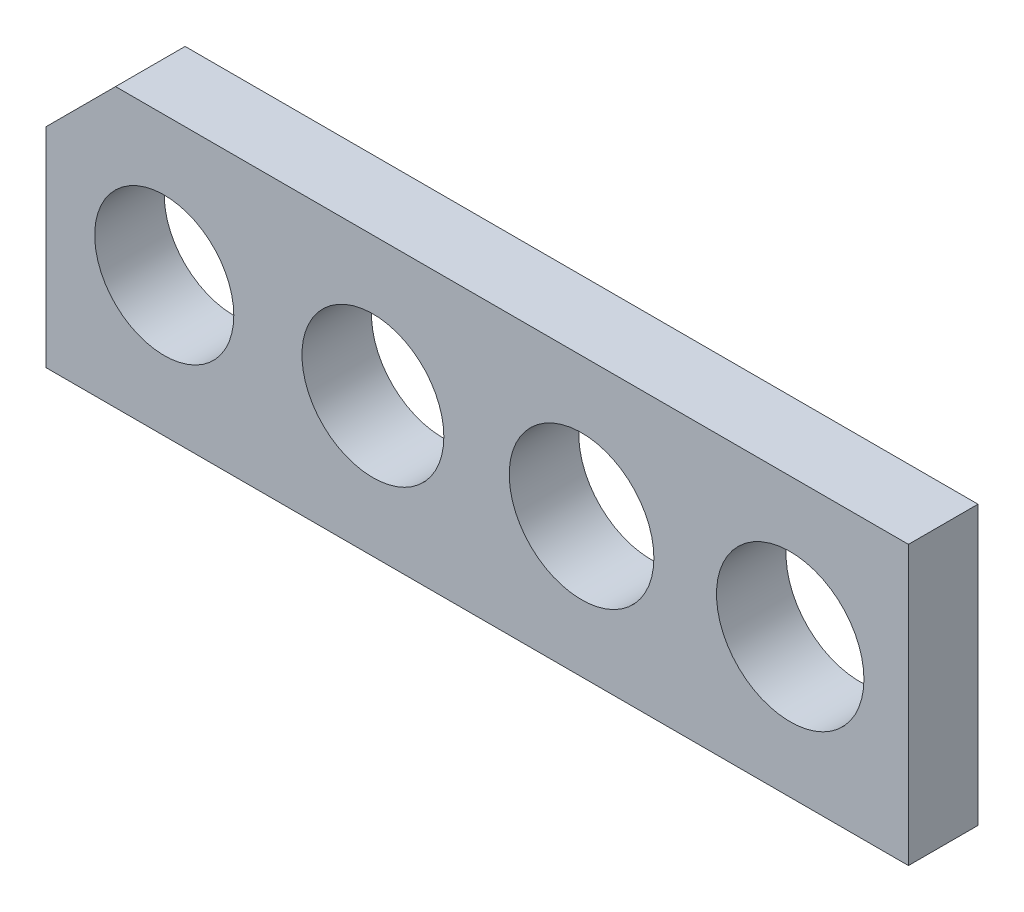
ISO-10303-21;
HEADER;
FILE_DESCRIPTION(('STEP AP214'),'2;1');
FILE_NAME('part.step','',(''),(''),'','','');
FILE_SCHEMA(('AUTOMOTIVE_DESIGN { 1 0 10303 214 1 1 1 1 }'));
ENDSEC;
DATA;
#1=APPLICATION_CONTEXT('core data for automotive mechanical design processes');
#2=APPLICATION_PROTOCOL_DEFINITION('international standard','automotive_design',2000,#1);
#3=PRODUCT_CONTEXT('',#1,'mechanical');
#4=PRODUCT('Part','Part','',(#3));
#5=PRODUCT_RELATED_PRODUCT_CATEGORY('part','',(#4));
#6=PRODUCT_DEFINITION_FORMATION('','',#4);
#7=PRODUCT_DEFINITION_CONTEXT('part definition',#1,'design');
#8=PRODUCT_DEFINITION('design','',#6,#7);
#9=PRODUCT_DEFINITION_SHAPE('','',#8);
#10=(LENGTH_UNIT() NAMED_UNIT(*) SI_UNIT(.MILLI.,.METRE.));
#11=(NAMED_UNIT(*) PLANE_ANGLE_UNIT() SI_UNIT($,.RADIAN.));
#12=(NAMED_UNIT(*) SI_UNIT($,.STERADIAN.) SOLID_ANGLE_UNIT());
#13=UNCERTAINTY_MEASURE_WITH_UNIT(LENGTH_MEASURE(1.E-05),#10,'distance_accuracy_value','');
#14=(GEOMETRIC_REPRESENTATION_CONTEXT(3) GLOBAL_UNCERTAINTY_ASSIGNED_CONTEXT((#13)) GLOBAL_UNIT_ASSIGNED_CONTEXT((#10,
#11,#12)) REPRESENTATION_CONTEXT('',''));
#15=CARTESIAN_POINT('',(0.,0.,0.));
#16=DIRECTION('',(0.,0.,1.));
#17=DIRECTION('',(1.,0.,0.));
#18=AXIS2_PLACEMENT_3D('',#15,#16,#17);
#19=CARTESIAN_POINT('',(0.,0.,5.));
#20=DIRECTION('',(0.,0.,1.));
#21=DIRECTION('',(1.,0.,0.));
#22=AXIS2_PLACEMENT_3D('',#19,#20,#21);
#23=PLANE('',#22);
#24=CARTESIAN_POINT('',(7.5,0.,5.));
#25=DIRECTION('',(0.,0.,1.));
#26=DIRECTION('',(1.,0.,0.));
#27=AXIS2_PLACEMENT_3D('',#24,#25,#26);
#28=CIRCLE('',#27,5.2);
#29=CARTESIAN_POINT('',(12.7,0.,5.));
#30=VERTEX_POINT('',#29);
#31=EDGE_CURVE('E182',#30,#30,#28,.T.);
#32=ORIENTED_EDGE('',*,*,#31,.F.);
#33=EDGE_LOOP('',(#32));
#34=FACE_BOUND('',#33,.T.);
#35=CARTESIAN_POINT('',(-22.5,0.,5.));
#36=DIRECTION('',(0.,0.,1.));
#37=DIRECTION('',(1.,0.,0.));
#38=AXIS2_PLACEMENT_3D('',#35,#36,#37);
#39=CIRCLE('',#38,5.);
#40=CARTESIAN_POINT('',(-17.5,0.,5.));
#41=VERTEX_POINT('',#40);
#42=EDGE_CURVE('E122',#41,#41,#39,.T.);
#43=ORIENTED_EDGE('',*,*,#42,.F.);
#44=EDGE_LOOP('',(#43));
#45=FACE_BOUND('',#44,.T.);
#46=DIRECTION('',(0.,-1.,0.));
#47=VECTOR('',#46,1.);
#48=CARTESIAN_POINT('',(-31.,5.,5.));
#49=LINE('',#48,#47);
#50=CARTESIAN_POINT('',(-31.,5.,5.));
#51=VERTEX_POINT('',#50);
#52=CARTESIAN_POINT('',(-31.,-10.,5.));
#53=VERTEX_POINT('',#52);
#54=EDGE_CURVE('E127',#51,#53,#49,.T.);
#55=ORIENTED_EDGE('',*,*,#54,.T.);
#56=DIRECTION('',(1.,0.,0.));
#57=VECTOR('',#56,1.);
#58=CARTESIAN_POINT('',(-31.,-10.,5.));
#59=LINE('',#58,#57);
#60=CARTESIAN_POINT('',(31.,-10.,5.));
#61=VERTEX_POINT('',#60);
#62=EDGE_CURVE('E94',#53,#61,#59,.T.);
#63=ORIENTED_EDGE('',*,*,#62,.T.);
#64=DIRECTION('',(0.,1.,0.));
#65=VECTOR('',#64,1.);
#66=CARTESIAN_POINT('',(31.,-10.,5.));
#67=LINE('',#66,#65);
#68=CARTESIAN_POINT('',(31.,10.,5.));
#69=VERTEX_POINT('',#68);
#70=EDGE_CURVE('E98',#61,#69,#67,.T.);
#71=ORIENTED_EDGE('',*,*,#70,.T.);
#72=DIRECTION('',(-1.,0.,0.));
#73=VECTOR('',#72,1.);
#74=CARTESIAN_POINT('',(31.,10.,5.));
#75=LINE('',#74,#73);
#76=CARTESIAN_POINT('',(-26.,10.,5.));
#77=VERTEX_POINT('',#76);
#78=EDGE_CURVE('E102',#69,#77,#75,.T.);
#79=ORIENTED_EDGE('',*,*,#78,.T.);
#80=DIRECTION('',(-0.707106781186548,-0.707106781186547,0.));
#81=VECTOR('',#80,1.);
#82=CARTESIAN_POINT('',(-26.,10.,5.));
#83=LINE('',#82,#81);
#84=EDGE_CURVE('E60',#77,#51,#83,.T.);
#85=ORIENTED_EDGE('',*,*,#84,.T.);
#86=EDGE_LOOP('',(#55,#63,#71,#79,#85));
#87=FACE_BOUND('',#86,.T.);
#88=CARTESIAN_POINT('',(-7.5,0.,5.));
#89=DIRECTION('',(0.,0.,1.));
#90=DIRECTION('',(1.,0.,0.));
#91=AXIS2_PLACEMENT_3D('',#88,#89,#90);
#92=CIRCLE('',#91,5.1);
#93=CARTESIAN_POINT('',(-2.4,0.,5.));
#94=VERTEX_POINT('',#93);
#95=EDGE_CURVE('E188',#94,#94,#92,.T.);
#96=ORIENTED_EDGE('',*,*,#95,.F.);
#97=EDGE_LOOP('',(#96));
#98=FACE_BOUND('',#97,.T.);
#99=CARTESIAN_POINT('',(22.5,0.,5.));
#100=DIRECTION('',(0.,0.,1.));
#101=DIRECTION('',(1.,0.,0.));
#102=AXIS2_PLACEMENT_3D('',#99,#100,#101);
#103=CIRCLE('',#102,5.3);
#104=CARTESIAN_POINT('',(27.8,0.,5.));
#105=VERTEX_POINT('',#104);
#106=EDGE_CURVE('E173',#105,#105,#103,.T.);
#107=ORIENTED_EDGE('',*,*,#106,.F.);
#108=EDGE_LOOP('',(#107));
#109=FACE_BOUND('',#108,.T.);
#110=ADVANCED_FACE('F43',(#34,#45,#87,#98,#109),#23,.T.);
#111=CARTESIAN_POINT('',(0.,0.,0.));
#112=DIRECTION('',(0.,0.,1.));
#113=DIRECTION('',(1.,0.,0.));
#114=AXIS2_PLACEMENT_3D('',#111,#112,#113);
#115=PLANE('',#114);
#116=DIRECTION('',(0.,-1.,0.));
#117=VECTOR('',#116,1.);
#118=CARTESIAN_POINT('',(-31.,5.,0.));
#119=LINE('',#118,#117);
#120=CARTESIAN_POINT('',(-31.,5.,0.));
#121=VERTEX_POINT('',#120);
#122=CARTESIAN_POINT('',(-31.,-10.,0.));
#123=VERTEX_POINT('',#122);
#124=EDGE_CURVE('E118',#121,#123,#119,.T.);
#125=ORIENTED_EDGE('',*,*,#124,.F.);
#126=DIRECTION('',(-0.707106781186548,-0.707106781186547,0.));
#127=VECTOR('',#126,1.);
#128=CARTESIAN_POINT('',(-26.,10.,0.));
#129=LINE('',#128,#127);
#130=CARTESIAN_POINT('',(-26.,10.,0.));
#131=VERTEX_POINT('',#130);
#132=EDGE_CURVE('E86',#131,#121,#129,.T.);
#133=ORIENTED_EDGE('',*,*,#132,.F.);
#134=DIRECTION('',(-1.,0.,0.));
#135=VECTOR('',#134,1.);
#136=CARTESIAN_POINT('',(31.,10.,0.));
#137=LINE('',#136,#135);
#138=CARTESIAN_POINT('',(31.,10.,0.));
#139=VERTEX_POINT('',#138);
#140=EDGE_CURVE('E80',#139,#131,#137,.T.);
#141=ORIENTED_EDGE('',*,*,#140,.F.);
#142=DIRECTION('',(0.,1.,0.));
#143=VECTOR('',#142,1.);
#144=CARTESIAN_POINT('',(31.,-10.,0.));
#145=LINE('',#144,#143);
#146=CARTESIAN_POINT('',(31.,-10.,0.));
#147=VERTEX_POINT('',#146);
#148=EDGE_CURVE('E109',#147,#139,#145,.T.);
#149=ORIENTED_EDGE('',*,*,#148,.F.);
#150=DIRECTION('',(1.,0.,0.));
#151=VECTOR('',#150,1.);
#152=CARTESIAN_POINT('',(-31.,-10.,0.));
#153=LINE('',#152,#151);
#154=EDGE_CURVE('E121',#123,#147,#153,.T.);
#155=ORIENTED_EDGE('',*,*,#154,.F.);
#156=EDGE_LOOP('',(#125,#133,#141,#149,#155));
#157=FACE_BOUND('',#156,.T.);
#158=CARTESIAN_POINT('',(-22.5,0.,0.));
#159=DIRECTION('',(0.,0.,1.));
#160=DIRECTION('',(1.,0.,0.));
#161=AXIS2_PLACEMENT_3D('',#158,#159,#160);
#162=CIRCLE('',#161,5.);
#163=CARTESIAN_POINT('',(-17.5,0.,0.));
#164=VERTEX_POINT('',#163);
#165=EDGE_CURVE('E191',#164,#164,#162,.T.);
#166=ORIENTED_EDGE('',*,*,#165,.T.);
#167=EDGE_LOOP('',(#166));
#168=FACE_BOUND('',#167,.T.);
#169=CARTESIAN_POINT('',(-7.5,0.,0.));
#170=DIRECTION('',(0.,0.,1.));
#171=DIRECTION('',(1.,0.,0.));
#172=AXIS2_PLACEMENT_3D('',#169,#170,#171);
#173=CIRCLE('',#172,5.1);
#174=CARTESIAN_POINT('',(-2.4,0.,0.));
#175=VERTEX_POINT('',#174);
#176=EDGE_CURVE('E185',#175,#175,#173,.T.);
#177=ORIENTED_EDGE('',*,*,#176,.T.);
#178=EDGE_LOOP('',(#177));
#179=FACE_BOUND('',#178,.T.);
#180=CARTESIAN_POINT('',(7.5,0.,0.));
#181=DIRECTION('',(0.,0.,1.));
#182=DIRECTION('',(1.,0.,0.));
#183=AXIS2_PLACEMENT_3D('',#180,#181,#182);
#184=CIRCLE('',#183,5.2);
#185=CARTESIAN_POINT('',(12.7,0.,0.));
#186=VERTEX_POINT('',#185);
#187=EDGE_CURVE('E179',#186,#186,#184,.T.);
#188=ORIENTED_EDGE('',*,*,#187,.T.);
#189=EDGE_LOOP('',(#188));
#190=FACE_BOUND('',#189,.T.);
#191=CARTESIAN_POINT('',(22.5,0.,0.));
#192=DIRECTION('',(0.,0.,1.));
#193=DIRECTION('',(1.,0.,0.));
#194=AXIS2_PLACEMENT_3D('',#191,#192,#193);
#195=CIRCLE('',#194,5.3);
#196=CARTESIAN_POINT('',(27.8,0.,0.));
#197=VERTEX_POINT('',#196);
#198=EDGE_CURVE('E176',#197,#197,#195,.T.);
#199=ORIENTED_EDGE('',*,*,#198,.T.);
#200=EDGE_LOOP('',(#199));
#201=FACE_BOUND('',#200,.T.);
#202=ADVANCED_FACE('F131',(#157,#168,#179,#190,#201),#115,.F.);
#203=CARTESIAN_POINT('',(-31.,5.,5.));
#204=DIRECTION('',(1.,0.,0.));
#205=DIRECTION('',(0.,0.,-1.));
#206=AXIS2_PLACEMENT_3D('',#203,#204,#205);
#207=PLANE('',#206);
#208=ORIENTED_EDGE('',*,*,#124,.T.);
#209=DIRECTION('',(0.,0.,-1.));
#210=VECTOR('',#209,1.);
#211=CARTESIAN_POINT('',(-31.,-10.,5.));
#212=LINE('',#211,#210);
#213=EDGE_CURVE('E11',#53,#123,#212,.T.);
#214=ORIENTED_EDGE('',*,*,#213,.F.);
#215=ORIENTED_EDGE('',*,*,#54,.F.);
#216=DIRECTION('',(0.,0.,-1.));
#217=VECTOR('',#216,1.);
#218=CARTESIAN_POINT('',(-31.,5.,5.));
#219=LINE('',#218,#217);
#220=EDGE_CURVE('E114',#51,#121,#219,.T.);
#221=ORIENTED_EDGE('',*,*,#220,.T.);
#222=EDGE_LOOP('',(#208,#214,#215,#221));
#223=FACE_BOUND('',#222,.T.);
#224=ADVANCED_FACE('F45',(#223),#207,.F.);
#225=CARTESIAN_POINT('',(-31.,-10.,5.));
#226=DIRECTION('',(0.,1.,0.));
#227=DIRECTION('',(0.,0.,1.));
#228=AXIS2_PLACEMENT_3D('',#225,#226,#227);
#229=PLANE('',#228);
#230=ORIENTED_EDGE('',*,*,#154,.T.);
#231=DIRECTION('',(0.,0.,-1.));
#232=VECTOR('',#231,1.);
#233=CARTESIAN_POINT('',(31.,-10.,5.));
#234=LINE('',#233,#232);
#235=EDGE_CURVE('E52',#61,#147,#234,.T.);
#236=ORIENTED_EDGE('',*,*,#235,.F.);
#237=ORIENTED_EDGE('',*,*,#62,.F.);
#238=ORIENTED_EDGE('',*,*,#213,.T.);
#239=EDGE_LOOP('',(#230,#236,#237,#238));
#240=FACE_BOUND('',#239,.T.);
#241=ADVANCED_FACE('F244',(#240),#229,.F.);
#242=CARTESIAN_POINT('',(31.,-10.,5.));
#243=DIRECTION('',(-1.,0.,0.));
#244=DIRECTION('',(0.,0.,1.));
#245=AXIS2_PLACEMENT_3D('',#242,#243,#244);
#246=PLANE('',#245);
#247=ORIENTED_EDGE('',*,*,#148,.T.);
#248=DIRECTION('',(0.,0.,-1.));
#249=VECTOR('',#248,1.);
#250=CARTESIAN_POINT('',(31.,10.,5.));
#251=LINE('',#250,#249);
#252=EDGE_CURVE('E106',#69,#139,#251,.T.);
#253=ORIENTED_EDGE('',*,*,#252,.F.);
#254=ORIENTED_EDGE('',*,*,#70,.F.);
#255=ORIENTED_EDGE('',*,*,#235,.T.);
#256=EDGE_LOOP('',(#247,#253,#254,#255));
#257=FACE_BOUND('',#256,.T.);
#258=ADVANCED_FACE('F107',(#257),#246,.F.);
#259=CARTESIAN_POINT('',(31.,10.,5.));
#260=DIRECTION('',(0.,-1.,0.));
#261=DIRECTION('',(0.,0.,-1.));
#262=AXIS2_PLACEMENT_3D('',#259,#260,#261);
#263=PLANE('',#262);
#264=ORIENTED_EDGE('',*,*,#140,.T.);
#265=DIRECTION('',(0.,0.,-1.));
#266=VECTOR('',#265,1.);
#267=CARTESIAN_POINT('',(-26.,10.,5.));
#268=LINE('',#267,#266);
#269=EDGE_CURVE('E110',#77,#131,#268,.T.);
#270=ORIENTED_EDGE('',*,*,#269,.F.);
#271=ORIENTED_EDGE('',*,*,#78,.F.);
#272=ORIENTED_EDGE('',*,*,#252,.T.);
#273=EDGE_LOOP('',(#264,#270,#271,#272));
#274=FACE_BOUND('',#273,.T.);
#275=ADVANCED_FACE('F112',(#274),#263,.F.);
#276=CARTESIAN_POINT('',(-26.,10.,5.));
#277=DIRECTION('',(0.707106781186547,-0.707106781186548,0.));
#278=DIRECTION('',(0.707106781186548,0.707106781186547,0.));
#279=AXIS2_PLACEMENT_3D('',#276,#277,#278);
#280=PLANE('',#279);
#281=ORIENTED_EDGE('',*,*,#132,.T.);
#282=ORIENTED_EDGE('',*,*,#220,.F.);
#283=ORIENTED_EDGE('',*,*,#84,.F.);
#284=ORIENTED_EDGE('',*,*,#269,.T.);
#285=EDGE_LOOP('',(#281,#282,#283,#284));
#286=FACE_BOUND('',#285,.T.);
#287=ADVANCED_FACE('F136',(#286),#280,.F.);
#288=CARTESIAN_POINT('',(-22.5,0.,5.));
#289=DIRECTION('',(0.,0.,-1.));
#290=DIRECTION('',(-1.,0.,0.));
#291=AXIS2_PLACEMENT_3D('',#288,#289,#290);
#292=CYLINDRICAL_SURFACE('',#291,5.);
#293=ORIENTED_EDGE('',*,*,#42,.T.);
#294=EDGE_LOOP('',(#293));
#295=FACE_BOUND('',#294,.T.);
#296=ORIENTED_EDGE('',*,*,#165,.F.);
#297=EDGE_LOOP('',(#296));
#298=FACE_BOUND('',#297,.T.);
#299=ADVANCED_FACE('F138',(#295,#298),#292,.F.);
#300=CARTESIAN_POINT('',(-7.5,0.,5.));
#301=DIRECTION('',(0.,0.,-1.));
#302=DIRECTION('',(-1.,0.,0.));
#303=AXIS2_PLACEMENT_3D('',#300,#301,#302);
#304=CYLINDRICAL_SURFACE('',#303,5.1);
#305=ORIENTED_EDGE('',*,*,#95,.T.);
#306=EDGE_LOOP('',(#305));
#307=FACE_BOUND('',#306,.T.);
#308=ORIENTED_EDGE('',*,*,#176,.F.);
#309=EDGE_LOOP('',(#308));
#310=FACE_BOUND('',#309,.T.);
#311=ADVANCED_FACE('F144',(#307,#310),#304,.F.);
#312=CARTESIAN_POINT('',(7.5,0.,5.));
#313=DIRECTION('',(0.,0.,-1.));
#314=DIRECTION('',(-1.,0.,0.));
#315=AXIS2_PLACEMENT_3D('',#312,#313,#314);
#316=CYLINDRICAL_SURFACE('',#315,5.2);
#317=ORIENTED_EDGE('',*,*,#31,.T.);
#318=EDGE_LOOP('',(#317));
#319=FACE_BOUND('',#318,.T.);
#320=ORIENTED_EDGE('',*,*,#187,.F.);
#321=EDGE_LOOP('',(#320));
#322=FACE_BOUND('',#321,.T.);
#323=ADVANCED_FACE('F160',(#319,#322),#316,.F.);
#324=CARTESIAN_POINT('',(22.5,0.,5.));
#325=DIRECTION('',(0.,0.,-1.));
#326=DIRECTION('',(-1.,0.,0.));
#327=AXIS2_PLACEMENT_3D('',#324,#325,#326);
#328=CYLINDRICAL_SURFACE('',#327,5.3);
#329=ORIENTED_EDGE('',*,*,#106,.T.);
#330=EDGE_LOOP('',(#329));
#331=FACE_BOUND('',#330,.T.);
#332=ORIENTED_EDGE('',*,*,#198,.F.);
#333=EDGE_LOOP('',(#332));
#334=FACE_BOUND('',#333,.T.);
#335=ADVANCED_FACE('F164',(#331,#334),#328,.F.);
#336=CLOSED_SHELL('',(#110,#202,#224,#241,#258,#275,#287,#299,#311,#323,#335));
#337=MANIFOLD_SOLID_BREP('B2',#336);
#338=ADVANCED_BREP_SHAPE_REPRESENTATION('',(#18,#337),#14);
#339=SHAPE_DEFINITION_REPRESENTATION(#9,#338);
ENDSEC;
END-ISO-10303-21;
